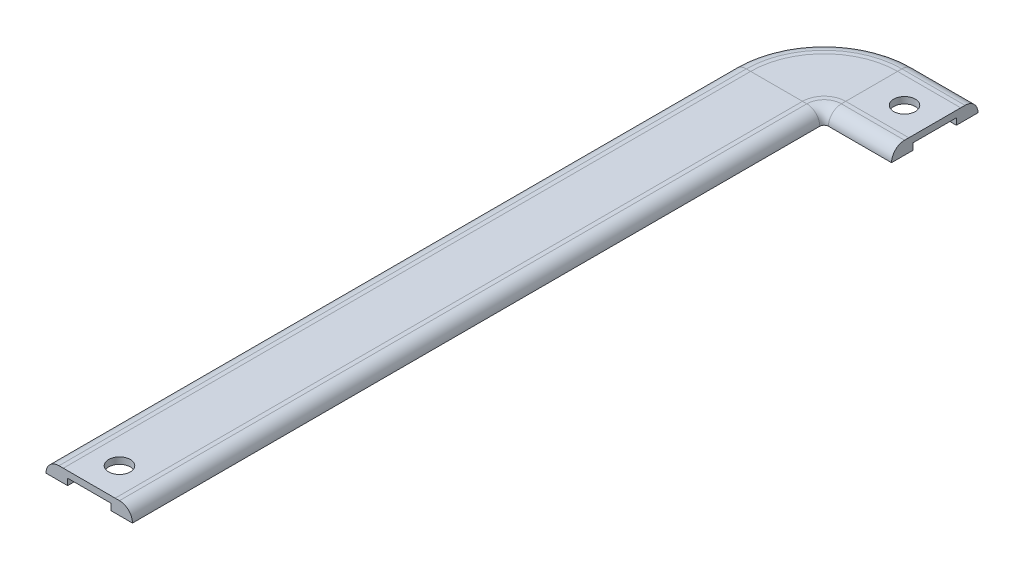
ISO-10303-21;
HEADER;
FILE_DESCRIPTION(('STEP AP214'),'2;1');
FILE_NAME('part.step','',(''),(''),'','','');
FILE_SCHEMA(('AUTOMOTIVE_DESIGN { 1 0 10303 214 1 1 1 1 }'));
ENDSEC;
DATA;
#1=APPLICATION_CONTEXT('core data for automotive mechanical design processes');
#2=APPLICATION_PROTOCOL_DEFINITION('international standard','automotive_design',2000,#1);
#3=PRODUCT_CONTEXT('',#1,'mechanical');
#4=PRODUCT('Part','Part','',(#3));
#5=PRODUCT_RELATED_PRODUCT_CATEGORY('part','',(#4));
#6=PRODUCT_DEFINITION_FORMATION('','',#4);
#7=PRODUCT_DEFINITION_CONTEXT('part definition',#1,'design');
#8=PRODUCT_DEFINITION('design','',#6,#7);
#9=PRODUCT_DEFINITION_SHAPE('','',#8);
#10=(LENGTH_UNIT() NAMED_UNIT(*) SI_UNIT(.MILLI.,.METRE.));
#11=(NAMED_UNIT(*) PLANE_ANGLE_UNIT() SI_UNIT($,.RADIAN.));
#12=(NAMED_UNIT(*) SI_UNIT($,.STERADIAN.) SOLID_ANGLE_UNIT());
#13=UNCERTAINTY_MEASURE_WITH_UNIT(LENGTH_MEASURE(1.E-05),#10,'distance_accuracy_value','');
#14=(GEOMETRIC_REPRESENTATION_CONTEXT(3) GLOBAL_UNCERTAINTY_ASSIGNED_CONTEXT((#13)) GLOBAL_UNIT_ASSIGNED_CONTEXT((#10,
#11,#12)) REPRESENTATION_CONTEXT('',''));
#15=CARTESIAN_POINT('',(0.,0.,0.));
#16=DIRECTION('',(0.,0.,1.));
#17=DIRECTION('',(1.,0.,0.));
#18=AXIS2_PLACEMENT_3D('',#15,#16,#17);
#19=CARTESIAN_POINT('',(50.,2.13734877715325,49.7811368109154));
#20=DIRECTION('',(0.,-1.,0.));
#21=DIRECTION('',(0.,0.,-1.));
#22=AXIS2_PLACEMENT_3D('',#19,#20,#21);
#23=PLANE('',#22);
#24=DIRECTION('',(0.,0.,1.));
#25=VECTOR('',#24,1.);
#26=CARTESIAN_POINT('',(171.936219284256,2.13734877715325,49.7811368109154));
#27=LINE('',#26,#25);
#28=CARTESIAN_POINT('',(171.936219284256,2.13734877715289,102.781136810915));
#29=VERTEX_POINT('',#28);
#30=CARTESIAN_POINT('',(171.936219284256,2.13734877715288,103.781136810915));
#31=VERTEX_POINT('',#30);
#32=EDGE_CURVE('E70',#29,#31,#27,.T.);
#33=ORIENTED_EDGE('',*,*,#32,.F.);
#34=DIRECTION('',(1.,0.,0.));
#35=VECTOR('',#34,1.);
#36=CARTESIAN_POINT('',(50.,2.13734877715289,102.781136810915));
#37=LINE('',#36,#35);
#38=CARTESIAN_POINT('',(157.336219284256,2.13734877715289,102.781136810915));
#39=VERTEX_POINT('',#38);
#40=EDGE_CURVE('E63',#29,#39,#37,.F.);
#41=ORIENTED_EDGE('',*,*,#40,.T.);
#42=DIRECTION('',(0.,0.,-1.));
#43=VECTOR('',#42,1.);
#44=CARTESIAN_POINT('',(157.336219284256,2.13734877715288,103.781136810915));
#45=LINE('',#44,#43);
#46=CARTESIAN_POINT('',(157.336219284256,2.13734877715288,103.781136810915));
#47=VERTEX_POINT('',#46);
#48=EDGE_CURVE('E243',#47,#39,#45,.T.);
#49=ORIENTED_EDGE('',*,*,#48,.F.);
#50=DIRECTION('',(1.,0.,0.));
#51=VECTOR('',#50,1.);
#52=CARTESIAN_POINT('',(157.336219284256,2.13734877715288,103.781136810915));
#53=LINE('',#52,#51);
#54=EDGE_CURVE('E222',#47,#31,#53,.T.);
#55=ORIENTED_EDGE('',*,*,#54,.T.);
#56=EDGE_LOOP('',(#33,#41,#49,#55));
#57=FACE_BOUND('',#56,.T.);
#58=ADVANCED_FACE('F55',(#57),#23,.F.);
#59=CARTESIAN_POINT('',(0.,-0.862651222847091,99.7811368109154));
#60=DIRECTION('',(0.,1.,0.));
#61=DIRECTION('',(0.,0.,1.));
#62=AXIS2_PLACEMENT_3D('',#59,#60,#61);
#63=PLANE('',#62);
#64=DIRECTION('',(0.,0.,-1.));
#65=VECTOR('',#64,1.);
#66=CARTESIAN_POINT('',(171.936219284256,-0.862651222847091,99.7811368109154));
#67=LINE('',#66,#65);
#68=CARTESIAN_POINT('',(171.936219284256,-0.862651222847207,119.781136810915));
#69=VERTEX_POINT('',#68);
#70=CARTESIAN_POINT('',(171.936219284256,-0.862651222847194,114.781136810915));
#71=VERTEX_POINT('',#70);
#72=EDGE_CURVE('E383',#69,#71,#67,.T.);
#73=ORIENTED_EDGE('',*,*,#72,.F.);
#74=DIRECTION('',(-1.,0.,0.));
#75=VECTOR('',#74,1.);
#76=CARTESIAN_POINT('',(180.,-0.862651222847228,119.781136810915));
#77=LINE('',#76,#75);
#78=CARTESIAN_POINT('',(157.336219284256,-0.862651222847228,119.781136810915));
#79=VERTEX_POINT('',#78);
#80=EDGE_CURVE('E212',#69,#79,#77,.T.);
#81=ORIENTED_EDGE('',*,*,#80,.T.);
#82=DIRECTION('',(0.,0.,1.));
#83=VECTOR('',#82,1.);
#84=CARTESIAN_POINT('',(157.336219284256,-0.862651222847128,114.781136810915));
#85=LINE('',#84,#83);
#86=CARTESIAN_POINT('',(157.336219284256,-0.862651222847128,114.781136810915));
#87=VERTEX_POINT('',#86);
#88=EDGE_CURVE('E307',#87,#79,#85,.T.);
#89=ORIENTED_EDGE('',*,*,#88,.F.);
#90=DIRECTION('',(-1.,0.,0.));
#91=VECTOR('',#90,1.);
#92=CARTESIAN_POINT('',(181.936219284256,-0.862651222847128,114.781136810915));
#93=LINE('',#92,#91);
#94=EDGE_CURVE('E221',#71,#87,#93,.T.);
#95=ORIENTED_EDGE('',*,*,#94,.F.);
#96=EDGE_LOOP('',(#73,#81,#89,#95));
#97=FACE_BOUND('',#96,.T.);
#98=ADVANCED_FACE('F57',(#97),#63,.F.);
#99=DIRECTION('',(0.,0.,1.));
#100=VECTOR('',#99,1.);
#101=CARTESIAN_POINT('',(171.936219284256,2.13734877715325,49.7811368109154));
#102=LINE('',#101,#100);
#103=CARTESIAN_POINT('',(171.936219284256,2.1373487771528,115.781136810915));
#104=VERTEX_POINT('',#103);
#105=CARTESIAN_POINT('',(171.936219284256,2.13734877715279,116.781136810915));
#106=VERTEX_POINT('',#105);
#107=EDGE_CURVE('E388',#104,#106,#102,.T.);
#108=ORIENTED_EDGE('',*,*,#107,.F.);
#109=DIRECTION('',(1.,0.,0.));
#110=VECTOR('',#109,1.);
#111=CARTESIAN_POINT('',(157.336219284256,2.1373487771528,115.781136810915));
#112=LINE('',#111,#110);
#113=CARTESIAN_POINT('',(157.336219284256,2.1373487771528,115.781136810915));
#114=VERTEX_POINT('',#113);
#115=EDGE_CURVE('E229',#114,#104,#112,.T.);
#116=ORIENTED_EDGE('',*,*,#115,.F.);
#117=DIRECTION('',(0.,0.,-1.));
#118=VECTOR('',#117,1.);
#119=CARTESIAN_POINT('',(157.336219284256,2.13734877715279,116.781136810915));
#120=LINE('',#119,#118);
#121=CARTESIAN_POINT('',(157.336219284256,2.13734877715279,116.781136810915));
#122=VERTEX_POINT('',#121);
#123=EDGE_CURVE('E277',#122,#114,#120,.T.);
#124=ORIENTED_EDGE('',*,*,#123,.F.);
#125=DIRECTION('',(-1.,0.,0.));
#126=VECTOR('',#125,1.);
#127=CARTESIAN_POINT('',(50.,2.13734877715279,116.781136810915));
#128=LINE('',#127,#126);
#129=EDGE_CURVE('E211',#122,#106,#128,.F.);
#130=ORIENTED_EDGE('',*,*,#129,.T.);
#131=EDGE_LOOP('',(#108,#116,#124,#130));
#132=FACE_BOUND('',#131,.T.);
#133=ADVANCED_FACE('F468',(#132),#23,.F.);
#134=CARTESIAN_POINT('',(180.,-0.862651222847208,116.781136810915));
#135=DIRECTION('',(-1.,0.,0.));
#136=DIRECTION('',(0.,0.,-1.));
#137=AXIS2_PLACEMENT_3D('',#134,#135,#136);
#138=CYLINDRICAL_SURFACE('',#137,3.);
#139=ORIENTED_EDGE('',*,*,#80,.F.);
#140=CARTESIAN_POINT('',(171.936219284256,-0.862651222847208,116.781136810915));
#141=DIRECTION('',(1.,0.,0.));
#142=DIRECTION('',(0.,0.,-1.));
#143=AXIS2_PLACEMENT_3D('',#140,#141,#142);
#144=CIRCLE('',#143,3.);
#145=EDGE_CURVE('E204',#69,#106,#144,.F.);
#146=ORIENTED_EDGE('',*,*,#145,.T.);
#147=ORIENTED_EDGE('',*,*,#129,.F.);
#148=CARTESIAN_POINT('',(157.336219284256,-0.862651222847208,116.781136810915));
#149=DIRECTION('',(-1.,0.,0.));
#150=DIRECTION('',(0.,0.,1.));
#151=AXIS2_PLACEMENT_3D('',#148,#149,#150);
#152=CIRCLE('',#151,3.);
#153=EDGE_CURVE('E292',#79,#122,#152,.T.);
#154=ORIENTED_EDGE('',*,*,#153,.F.);
#155=EDGE_LOOP('',(#139,#146,#147,#154));
#156=FACE_BOUND('',#155,.T.);
#157=ADVANCED_FACE('F465',(#156),#138,.T.);
#158=CARTESIAN_POINT('',(50.0000000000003,-0.862651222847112,102.781136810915));
#159=DIRECTION('',(1.,0.,0.));
#160=DIRECTION('',(0.,0.,1.));
#161=AXIS2_PLACEMENT_3D('',#158,#159,#160);
#162=CYLINDRICAL_SURFACE('',#161,3.);
#163=ORIENTED_EDGE('',*,*,#40,.F.);
#164=CARTESIAN_POINT('',(171.936219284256,-0.862651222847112,102.781136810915));
#165=DIRECTION('',(1.,0.,0.));
#166=DIRECTION('',(0.,0.,-1.));
#167=AXIS2_PLACEMENT_3D('',#164,#165,#166);
#168=CIRCLE('',#167,3.);
#169=CARTESIAN_POINT('',(171.936219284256,-0.862651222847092,99.7811368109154));
#170=VERTEX_POINT('',#169);
#171=EDGE_CURVE('E192',#29,#170,#168,.F.);
#172=ORIENTED_EDGE('',*,*,#171,.T.);
#173=DIRECTION('',(1.,0.,0.));
#174=VECTOR('',#173,1.);
#175=CARTESIAN_POINT('',(50.0000000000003,-0.862651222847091,99.7811368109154));
#176=LINE('',#175,#174);
#177=CARTESIAN_POINT('',(157.336219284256,-0.862651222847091,99.7811368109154));
#178=VERTEX_POINT('',#177);
#179=EDGE_CURVE('E202',#178,#170,#176,.T.);
#180=ORIENTED_EDGE('',*,*,#179,.F.);
#181=CARTESIAN_POINT('',(157.336219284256,-0.862651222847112,102.781136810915));
#182=DIRECTION('',(-1.,0.,0.));
#183=DIRECTION('',(0.,0.,1.));
#184=AXIS2_PLACEMENT_3D('',#181,#182,#183);
#185=CIRCLE('',#184,2.99999999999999);
#186=EDGE_CURVE('E227',#39,#178,#185,.T.);
#187=ORIENTED_EDGE('',*,*,#186,.F.);
#188=EDGE_LOOP('',(#163,#172,#180,#187));
#189=FACE_BOUND('',#188,.T.);
#190=ADVANCED_FACE('F201',(#189),#162,.T.);
#191=DIRECTION('',(0.,0.,-1.));
#192=VECTOR('',#191,1.);
#193=CARTESIAN_POINT('',(171.936219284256,-0.862651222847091,99.7811368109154));
#194=LINE('',#193,#192);
#195=CARTESIAN_POINT('',(171.936219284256,-0.862651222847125,104.781136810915));
#196=VERTEX_POINT('',#195);
#197=EDGE_CURVE('E189',#196,#170,#194,.T.);
#198=ORIENTED_EDGE('',*,*,#197,.F.);
#199=DIRECTION('',(-1.,0.,0.));
#200=VECTOR('',#199,1.);
#201=CARTESIAN_POINT('',(181.936219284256,-0.862651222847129,104.781136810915));
#202=LINE('',#201,#200);
#203=CARTESIAN_POINT('',(157.336219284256,-0.862651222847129,104.781136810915));
#204=VERTEX_POINT('',#203);
#205=EDGE_CURVE('E218',#196,#204,#202,.T.);
#206=ORIENTED_EDGE('',*,*,#205,.T.);
#207=DIRECTION('',(0.,0.,1.));
#208=VECTOR('',#207,1.);
#209=CARTESIAN_POINT('',(157.336219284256,-0.862651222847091,99.7811368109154));
#210=LINE('',#209,#208);
#211=EDGE_CURVE('E209',#178,#204,#210,.T.);
#212=ORIENTED_EDGE('',*,*,#211,.F.);
#213=ORIENTED_EDGE('',*,*,#179,.T.);
#214=EDGE_LOOP('',(#198,#206,#212,#213));
#215=FACE_BOUND('',#214,.T.);
#216=ADVANCED_FACE('F207',(#215),#63,.F.);
#217=CARTESIAN_POINT('',(50.,0.63734877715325,49.7811368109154));
#218=DIRECTION('',(0.,-1.,0.));
#219=DIRECTION('',(0.,0.,-1.));
#220=AXIS2_PLACEMENT_3D('',#217,#218,#219);
#221=PLANE('',#220);
#222=CARTESIAN_POINT('',(164.936219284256,0.637348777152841,109.781136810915));
#223=DIRECTION('',(0.,-1.,0.));
#224=DIRECTION('',(0.,0.,-1.));
#225=AXIS2_PLACEMENT_3D('',#222,#223,#224);
#226=CIRCLE('',#225,2.5);
#227=CARTESIAN_POINT('',(164.936219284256,0.637348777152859,107.281136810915));
#228=VERTEX_POINT('',#227);
#229=EDGE_CURVE('E393',#228,#228,#226,.T.);
#230=ORIENTED_EDGE('',*,*,#229,.F.);
#231=EDGE_LOOP('',(#230));
#232=FACE_BOUND('',#231,.T.);
#233=DIRECTION('',(-1.,0.,0.));
#234=VECTOR('',#233,1.);
#235=CARTESIAN_POINT('',(181.936219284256,0.637348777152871,104.781136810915));
#236=LINE('',#235,#234);
#237=CARTESIAN_POINT('',(171.936219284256,0.637348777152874,104.781136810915));
#238=VERTEX_POINT('',#237);
#239=CARTESIAN_POINT('',(157.336219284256,0.637348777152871,104.781136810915));
#240=VERTEX_POINT('',#239);
#241=EDGE_CURVE('E216',#238,#240,#236,.T.);
#242=ORIENTED_EDGE('',*,*,#241,.F.);
#243=DIRECTION('',(0.,0.,1.));
#244=VECTOR('',#243,1.);
#245=CARTESIAN_POINT('',(171.936219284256,0.63734877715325,49.7811368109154));
#246=LINE('',#245,#244);
#247=CARTESIAN_POINT('',(171.936219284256,0.637348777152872,114.781136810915));
#248=VERTEX_POINT('',#247);
#249=EDGE_CURVE('E198',#238,#248,#246,.T.);
#250=ORIENTED_EDGE('',*,*,#249,.T.);
#251=DIRECTION('',(-1.,0.,0.));
#252=VECTOR('',#251,1.);
#253=CARTESIAN_POINT('',(181.936219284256,0.637348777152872,114.781136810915));
#254=LINE('',#253,#252);
#255=CARTESIAN_POINT('',(157.336219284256,0.637348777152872,114.781136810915));
#256=VERTEX_POINT('',#255);
#257=EDGE_CURVE('E224',#248,#256,#254,.T.);
#258=ORIENTED_EDGE('',*,*,#257,.T.);
#259=DIRECTION('',(0.,0.,1.));
#260=VECTOR('',#259,1.);
#261=CARTESIAN_POINT('',(157.336219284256,0.637348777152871,104.781136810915));
#262=LINE('',#261,#260);
#263=EDGE_CURVE('E337',#240,#256,#262,.T.);
#264=ORIENTED_EDGE('',*,*,#263,.F.);
#265=EDGE_LOOP('',(#242,#250,#258,#264));
#266=FACE_BOUND('',#265,.T.);
#267=ADVANCED_FACE('F490',(#232,#266),#221,.T.);
#268=CARTESIAN_POINT('',(181.936219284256,-0.862651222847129,104.781136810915));
#269=DIRECTION('',(0.,0.,-1.));
#270=DIRECTION('',(-1.,0.,0.));
#271=AXIS2_PLACEMENT_3D('',#268,#269,#270);
#272=PLANE('',#271);
#273=DIRECTION('',(0.,-1.,0.));
#274=VECTOR('',#273,1.);
#275=CARTESIAN_POINT('',(171.936219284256,-0.862651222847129,104.781136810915));
#276=LINE('',#275,#274);
#277=EDGE_CURVE('E194',#238,#196,#276,.T.);
#278=ORIENTED_EDGE('',*,*,#277,.F.);
#279=ORIENTED_EDGE('',*,*,#241,.T.);
#280=DIRECTION('',(0.,1.,0.));
#281=VECTOR('',#280,1.);
#282=CARTESIAN_POINT('',(157.336219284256,-0.862651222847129,104.781136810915));
#283=LINE('',#282,#281);
#284=EDGE_CURVE('E352',#204,#240,#283,.T.);
#285=ORIENTED_EDGE('',*,*,#284,.F.);
#286=ORIENTED_EDGE('',*,*,#205,.F.);
#287=EDGE_LOOP('',(#278,#279,#285,#286));
#288=FACE_BOUND('',#287,.T.);
#289=ADVANCED_FACE('F495',(#288),#272,.F.);
#290=CARTESIAN_POINT('',(181.936219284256,-0.862651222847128,114.781136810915));
#291=DIRECTION('',(0.,0.,1.));
#292=DIRECTION('',(1.,0.,0.));
#293=AXIS2_PLACEMENT_3D('',#290,#291,#292);
#294=PLANE('',#293);
#295=DIRECTION('',(0.,1.,0.));
#296=VECTOR('',#295,1.);
#297=CARTESIAN_POINT('',(171.936219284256,-0.862651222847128,114.781136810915));
#298=LINE('',#297,#296);
#299=EDGE_CURVE('E381',#71,#248,#298,.T.);
#300=ORIENTED_EDGE('',*,*,#299,.F.);
#301=ORIENTED_EDGE('',*,*,#94,.T.);
#302=DIRECTION('',(0.,-1.,0.));
#303=VECTOR('',#302,1.);
#304=CARTESIAN_POINT('',(157.336219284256,0.637348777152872,114.781136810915));
#305=LINE('',#304,#303);
#306=EDGE_CURVE('E322',#256,#87,#305,.T.);
#307=ORIENTED_EDGE('',*,*,#306,.F.);
#308=ORIENTED_EDGE('',*,*,#257,.F.);
#309=EDGE_LOOP('',(#300,#301,#307,#308));
#310=FACE_BOUND('',#309,.T.);
#311=ADVANCED_FACE('F501',(#310),#294,.F.);
#312=CARTESIAN_POINT('',(139.336219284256,-0.862651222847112,279.781136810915));
#313=DIRECTION('',(0.,0.,1.));
#314=DIRECTION('',(1.,0.,0.));
#315=AXIS2_PLACEMENT_3D('',#312,#313,#314);
#316=PLANE('',#315);
#317=CARTESIAN_POINT('',(139.336219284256,-0.862651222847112,279.781136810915));
#318=DIRECTION('',(0.,0.,1.));
#319=DIRECTION('',(1.,0.,0.));
#320=AXIS2_PLACEMENT_3D('',#317,#318,#319);
#321=CIRCLE('',#320,2.99999999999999);
#322=CARTESIAN_POINT('',(139.336219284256,2.13734877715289,279.781136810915));
#323=VERTEX_POINT('',#322);
#324=CARTESIAN_POINT('',(136.336219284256,-0.862651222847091,279.781136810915));
#325=VERTEX_POINT('',#324);
#326=EDGE_CURVE('E236',#323,#325,#321,.T.);
#327=ORIENTED_EDGE('',*,*,#326,.T.);
#328=DIRECTION('',(1.,0.,0.));
#329=VECTOR('',#328,1.);
#330=CARTESIAN_POINT('',(136.336219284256,-0.862651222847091,279.781136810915));
#331=LINE('',#330,#329);
#332=CARTESIAN_POINT('',(141.336219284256,-0.862651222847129,279.781136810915));
#333=VERTEX_POINT('',#332);
#334=EDGE_CURVE('E364',#325,#333,#331,.T.);
#335=ORIENTED_EDGE('',*,*,#334,.T.);
#336=DIRECTION('',(0.,1.,0.));
#337=VECTOR('',#336,1.);
#338=CARTESIAN_POINT('',(141.336219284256,-0.862651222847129,279.781136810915));
#339=LINE('',#338,#337);
#340=CARTESIAN_POINT('',(141.336219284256,0.637348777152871,279.781136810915));
#341=VERTEX_POINT('',#340);
#342=EDGE_CURVE('E349',#333,#341,#339,.T.);
#343=ORIENTED_EDGE('',*,*,#342,.T.);
#344=DIRECTION('',(1.,0.,0.));
#345=VECTOR('',#344,1.);
#346=CARTESIAN_POINT('',(141.336219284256,0.637348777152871,279.781136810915));
#347=LINE('',#346,#345);
#348=CARTESIAN_POINT('',(151.336219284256,0.637348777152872,279.781136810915));
#349=VERTEX_POINT('',#348);
#350=EDGE_CURVE('E334',#341,#349,#347,.T.);
#351=ORIENTED_EDGE('',*,*,#350,.T.);
#352=DIRECTION('',(0.,-1.,0.));
#353=VECTOR('',#352,1.);
#354=CARTESIAN_POINT('',(151.336219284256,0.637348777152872,279.781136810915));
#355=LINE('',#354,#353);
#356=CARTESIAN_POINT('',(151.336219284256,-0.862651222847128,279.781136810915));
#357=VERTEX_POINT('',#356);
#358=EDGE_CURVE('E319',#349,#357,#355,.T.);
#359=ORIENTED_EDGE('',*,*,#358,.T.);
#360=DIRECTION('',(1.,0.,0.));
#361=VECTOR('',#360,1.);
#362=CARTESIAN_POINT('',(151.336219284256,-0.862651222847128,279.781136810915));
#363=LINE('',#362,#361);
#364=CARTESIAN_POINT('',(156.336219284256,-0.862651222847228,279.781136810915));
#365=VERTEX_POINT('',#364);
#366=EDGE_CURVE('E304',#357,#365,#363,.T.);
#367=ORIENTED_EDGE('',*,*,#366,.T.);
#368=CARTESIAN_POINT('',(153.336219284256,-0.862651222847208,279.781136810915));
#369=DIRECTION('',(0.,0.,1.));
#370=DIRECTION('',(1.,0.,0.));
#371=AXIS2_PLACEMENT_3D('',#368,#369,#370);
#372=CIRCLE('',#371,3.);
#373=CARTESIAN_POINT('',(153.336219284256,2.13734877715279,279.781136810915));
#374=VERTEX_POINT('',#373);
#375=EDGE_CURVE('E289',#365,#374,#372,.T.);
#376=ORIENTED_EDGE('',*,*,#375,.T.);
#377=DIRECTION('',(-1.,0.,0.));
#378=VECTOR('',#377,1.);
#379=CARTESIAN_POINT('',(153.336219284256,2.13734877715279,279.781136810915));
#380=LINE('',#379,#378);
#381=CARTESIAN_POINT('',(152.336219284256,2.1373487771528,279.781136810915));
#382=VERTEX_POINT('',#381);
#383=EDGE_CURVE('E272',#374,#382,#380,.T.);
#384=ORIENTED_EDGE('',*,*,#383,.T.);
#385=DIRECTION('',(-1.,0.,0.));
#386=VECTOR('',#385,1.);
#387=CARTESIAN_POINT('',(152.336219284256,2.1373487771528,279.781136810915));
#388=LINE('',#387,#386);
#389=CARTESIAN_POINT('',(140.336219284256,2.13734877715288,279.781136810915));
#390=VERTEX_POINT('',#389);
#391=EDGE_CURVE('E255',#382,#390,#388,.T.);
#392=ORIENTED_EDGE('',*,*,#391,.T.);
#393=DIRECTION('',(-1.,0.,0.));
#394=VECTOR('',#393,1.);
#395=CARTESIAN_POINT('',(140.336219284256,2.13734877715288,279.781136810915));
#396=LINE('',#395,#394);
#397=EDGE_CURVE('E240',#390,#323,#396,.T.);
#398=ORIENTED_EDGE('',*,*,#397,.T.);
#399=EDGE_LOOP('',(#327,#335,#343,#351,#359,#367,#376,#384,#392,#398));
#400=FACE_BOUND('',#399,.T.);
#401=ADVANCED_FACE('F418',(#400),#316,.T.);
#402=CARTESIAN_POINT('',(136.336219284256,-0.862651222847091,279.781136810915));
#403=DIRECTION('',(0.,1.,0.));
#404=DIRECTION('',(-1.,0.,0.));
#405=AXIS2_PLACEMENT_3D('',#402,#403,#404);
#406=PLANE('',#405);
#407=DIRECTION('',(0.,0.,-1.));
#408=VECTOR('',#407,1.);
#409=CARTESIAN_POINT('',(141.336219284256,-0.862651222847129,279.781136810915));
#410=LINE('',#409,#408);
#411=CARTESIAN_POINT('',(141.336219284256,-0.862651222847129,120.781136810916));
#412=VERTEX_POINT('',#411);
#413=EDGE_CURVE('E361',#333,#412,#410,.T.);
#414=ORIENTED_EDGE('',*,*,#413,.F.);
#415=ORIENTED_EDGE('',*,*,#334,.F.);
#416=DIRECTION('',(0.,0.,-1.));
#417=VECTOR('',#416,1.);
#418=CARTESIAN_POINT('',(136.336219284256,-0.862651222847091,279.781136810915));
#419=LINE('',#418,#417);
#420=CARTESIAN_POINT('',(136.336219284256,-0.862651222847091,120.781136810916));
#421=VERTEX_POINT('',#420);
#422=EDGE_CURVE('E239',#325,#421,#419,.T.);
#423=ORIENTED_EDGE('',*,*,#422,.T.);
#424=DIRECTION('',(1.,0.,0.));
#425=VECTOR('',#424,1.);
#426=CARTESIAN_POINT('',(136.336219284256,-0.862651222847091,120.781136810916));
#427=LINE('',#426,#425);
#428=EDGE_CURVE('E371',#421,#412,#427,.T.);
#429=ORIENTED_EDGE('',*,*,#428,.T.);
#430=EDGE_LOOP('',(#414,#415,#423,#429));
#431=FACE_BOUND('',#430,.T.);
#432=ADVANCED_FACE('F441',(#431),#406,.F.);
#433=CARTESIAN_POINT('',(141.336219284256,-0.862651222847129,279.781136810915));
#434=DIRECTION('',(-1.,0.,0.));
#435=DIRECTION('',(0.,0.,1.));
#436=AXIS2_PLACEMENT_3D('',#433,#434,#435);
#437=PLANE('',#436);
#438=DIRECTION('',(0.,0.,-1.));
#439=VECTOR('',#438,1.);
#440=CARTESIAN_POINT('',(141.336219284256,0.637348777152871,279.781136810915));
#441=LINE('',#440,#439);
#442=CARTESIAN_POINT('',(141.336219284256,0.637348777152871,120.781136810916));
#443=VERTEX_POINT('',#442);
#444=EDGE_CURVE('E346',#341,#443,#441,.T.);
#445=ORIENTED_EDGE('',*,*,#444,.F.);
#446=ORIENTED_EDGE('',*,*,#342,.F.);
#447=ORIENTED_EDGE('',*,*,#413,.T.);
#448=DIRECTION('',(0.,1.,0.));
#449=VECTOR('',#448,1.);
#450=CARTESIAN_POINT('',(141.336219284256,-0.862651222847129,120.781136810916));
#451=LINE('',#450,#449);
#452=EDGE_CURVE('E358',#412,#443,#451,.T.);
#453=ORIENTED_EDGE('',*,*,#452,.T.);
#454=EDGE_LOOP('',(#445,#446,#447,#453));
#455=FACE_BOUND('',#454,.T.);
#456=ADVANCED_FACE('F443',(#455),#437,.F.);
#457=CARTESIAN_POINT('',(141.336219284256,0.637348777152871,279.781136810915));
#458=DIRECTION('',(0.,1.,0.));
#459=DIRECTION('',(-1.,0.,0.));
#460=AXIS2_PLACEMENT_3D('',#457,#458,#459);
#461=PLANE('',#460);
#462=CARTESIAN_POINT('',(146.336219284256,0.637348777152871,272.781136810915));
#463=DIRECTION('',(0.,1.,0.));
#464=DIRECTION('',(-1.,0.,0.));
#465=AXIS2_PLACEMENT_3D('',#462,#463,#464);
#466=CIRCLE('',#465,2.5);
#467=CARTESIAN_POINT('',(143.836219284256,0.637348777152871,272.781136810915));
#468=VERTEX_POINT('',#467);
#469=EDGE_CURVE('E390',#468,#468,#466,.T.);
#470=ORIENTED_EDGE('',*,*,#469,.T.);
#471=EDGE_LOOP('',(#470));
#472=FACE_BOUND('',#471,.T.);
#473=DIRECTION('',(0.,0.,-1.));
#474=VECTOR('',#473,1.);
#475=CARTESIAN_POINT('',(151.336219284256,0.637348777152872,279.781136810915));
#476=LINE('',#475,#474);
#477=CARTESIAN_POINT('',(151.336219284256,0.637348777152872,120.781136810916));
#478=VERTEX_POINT('',#477);
#479=EDGE_CURVE('E331',#349,#478,#476,.T.);
#480=ORIENTED_EDGE('',*,*,#479,.F.);
#481=ORIENTED_EDGE('',*,*,#350,.F.);
#482=ORIENTED_EDGE('',*,*,#444,.T.);
#483=DIRECTION('',(1.,0.,0.));
#484=VECTOR('',#483,1.);
#485=CARTESIAN_POINT('',(141.336219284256,0.637348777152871,120.781136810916));
#486=LINE('',#485,#484);
#487=EDGE_CURVE('E343',#443,#478,#486,.T.);
#488=ORIENTED_EDGE('',*,*,#487,.T.);
#489=EDGE_LOOP('',(#480,#481,#482,#488));
#490=FACE_BOUND('',#489,.T.);
#491=ADVANCED_FACE('F447',(#472,#490),#461,.F.);
#492=CARTESIAN_POINT('',(151.336219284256,0.637348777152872,279.781136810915));
#493=DIRECTION('',(1.,0.,0.));
#494=DIRECTION('',(0.,0.,-1.));
#495=AXIS2_PLACEMENT_3D('',#492,#493,#494);
#496=PLANE('',#495);
#497=DIRECTION('',(0.,0.,-1.));
#498=VECTOR('',#497,1.);
#499=CARTESIAN_POINT('',(151.336219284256,-0.862651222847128,279.781136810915));
#500=LINE('',#499,#498);
#501=CARTESIAN_POINT('',(151.336219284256,-0.862651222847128,120.781136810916));
#502=VERTEX_POINT('',#501);
#503=EDGE_CURVE('E316',#357,#502,#500,.T.);
#504=ORIENTED_EDGE('',*,*,#503,.F.);
#505=ORIENTED_EDGE('',*,*,#358,.F.);
#506=ORIENTED_EDGE('',*,*,#479,.T.);
#507=DIRECTION('',(0.,-1.,0.));
#508=VECTOR('',#507,1.);
#509=CARTESIAN_POINT('',(151.336219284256,0.637348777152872,120.781136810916));
#510=LINE('',#509,#508);
#511=EDGE_CURVE('E328',#478,#502,#510,.T.);
#512=ORIENTED_EDGE('',*,*,#511,.T.);
#513=EDGE_LOOP('',(#504,#505,#506,#512));
#514=FACE_BOUND('',#513,.T.);
#515=ADVANCED_FACE('F452',(#514),#496,.F.);
#516=CARTESIAN_POINT('',(151.336219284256,-0.862651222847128,279.781136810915));
#517=DIRECTION('',(0.,1.,0.));
#518=DIRECTION('',(-1.,0.,0.));
#519=AXIS2_PLACEMENT_3D('',#516,#517,#518);
#520=PLANE('',#519);
#521=DIRECTION('',(0.,0.,-1.));
#522=VECTOR('',#521,1.);
#523=CARTESIAN_POINT('',(156.336219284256,-0.862651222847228,279.781136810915));
#524=LINE('',#523,#522);
#525=CARTESIAN_POINT('',(156.336219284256,-0.862651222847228,120.781136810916));
#526=VERTEX_POINT('',#525);
#527=EDGE_CURVE('E301',#365,#526,#524,.T.);
#528=ORIENTED_EDGE('',*,*,#527,.F.);
#529=ORIENTED_EDGE('',*,*,#366,.F.);
#530=ORIENTED_EDGE('',*,*,#503,.T.);
#531=DIRECTION('',(1.,0.,0.));
#532=VECTOR('',#531,1.);
#533=CARTESIAN_POINT('',(151.336219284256,-0.862651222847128,120.781136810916));
#534=LINE('',#533,#532);
#535=EDGE_CURVE('E313',#502,#526,#534,.T.);
#536=ORIENTED_EDGE('',*,*,#535,.T.);
#537=EDGE_LOOP('',(#528,#529,#530,#536));
#538=FACE_BOUND('',#537,.T.);
#539=ADVANCED_FACE('F455',(#538),#520,.F.);
#540=CARTESIAN_POINT('',(153.336219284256,-0.862651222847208,279.781136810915));
#541=DIRECTION('',(0.,0.,-1.));
#542=DIRECTION('',(-1.,0.,0.));
#543=AXIS2_PLACEMENT_3D('',#540,#541,#542);
#544=CYLINDRICAL_SURFACE('',#543,3.);
#545=DIRECTION('',(0.,0.,-1.));
#546=VECTOR('',#545,1.);
#547=CARTESIAN_POINT('',(153.336219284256,2.13734877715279,279.781136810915));
#548=LINE('',#547,#546);
#549=CARTESIAN_POINT('',(153.336219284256,2.13734877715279,120.781136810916));
#550=VERTEX_POINT('',#549);
#551=EDGE_CURVE('E286',#374,#550,#548,.T.);
#552=ORIENTED_EDGE('',*,*,#551,.F.);
#553=ORIENTED_EDGE('',*,*,#375,.F.);
#554=ORIENTED_EDGE('',*,*,#527,.T.);
#555=CARTESIAN_POINT('',(153.336219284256,-0.862651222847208,120.781136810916));
#556=DIRECTION('',(0.,0.,1.));
#557=DIRECTION('',(1.,0.,0.));
#558=AXIS2_PLACEMENT_3D('',#555,#556,#557);
#559=CIRCLE('',#558,3.);
#560=EDGE_CURVE('E298',#526,#550,#559,.T.);
#561=ORIENTED_EDGE('',*,*,#560,.T.);
#562=EDGE_LOOP('',(#552,#553,#554,#561));
#563=FACE_BOUND('',#562,.T.);
#564=ADVANCED_FACE('F458',(#563),#544,.T.);
#565=CARTESIAN_POINT('',(153.336219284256,2.13734877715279,279.781136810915));
#566=DIRECTION('',(0.,-1.,0.));
#567=DIRECTION('',(1.,0.,0.));
#568=AXIS2_PLACEMENT_3D('',#565,#566,#567);
#569=PLANE('',#568);
#570=DIRECTION('',(0.,0.,-1.));
#571=VECTOR('',#570,1.);
#572=CARTESIAN_POINT('',(152.336219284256,2.1373487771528,279.781136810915));
#573=LINE('',#572,#571);
#574=CARTESIAN_POINT('',(152.336219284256,2.1373487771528,120.781136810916));
#575=VERTEX_POINT('',#574);
#576=EDGE_CURVE('E269',#382,#575,#573,.T.);
#577=ORIENTED_EDGE('',*,*,#576,.F.);
#578=ORIENTED_EDGE('',*,*,#383,.F.);
#579=ORIENTED_EDGE('',*,*,#551,.T.);
#580=DIRECTION('',(-1.,0.,0.));
#581=VECTOR('',#580,1.);
#582=CARTESIAN_POINT('',(153.336219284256,2.13734877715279,120.781136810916));
#583=LINE('',#582,#581);
#584=EDGE_CURVE('E283',#550,#575,#583,.T.);
#585=ORIENTED_EDGE('',*,*,#584,.T.);
#586=EDGE_LOOP('',(#577,#578,#579,#585));
#587=FACE_BOUND('',#586,.T.);
#588=ADVANCED_FACE('F410',(#587),#569,.F.);
#589=CARTESIAN_POINT('',(152.336219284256,2.1373487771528,279.781136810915));
#590=DIRECTION('',(0.,-1.,0.));
#591=DIRECTION('',(1.,0.,0.));
#592=AXIS2_PLACEMENT_3D('',#589,#590,#591);
#593=PLANE('',#592);
#594=CARTESIAN_POINT('',(146.336219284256,2.13734877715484,272.781136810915));
#595=DIRECTION('',(0.,1.,0.));
#596=DIRECTION('',(-1.,0.,0.));
#597=AXIS2_PLACEMENT_3D('',#594,#595,#596);
#598=CIRCLE('',#597,2.5);
#599=CARTESIAN_POINT('',(143.836219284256,2.13734877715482,272.781136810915));
#600=VERTEX_POINT('',#599);
#601=EDGE_CURVE('E396',#600,#600,#598,.T.);
#602=ORIENTED_EDGE('',*,*,#601,.F.);
#603=EDGE_LOOP('',(#602));
#604=FACE_BOUND('',#603,.T.);
#605=DIRECTION('',(0.,0.,-1.));
#606=VECTOR('',#605,1.);
#607=CARTESIAN_POINT('',(140.336219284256,2.13734877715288,279.781136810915));
#608=LINE('',#607,#606);
#609=CARTESIAN_POINT('',(140.336219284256,2.13734877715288,120.781136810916));
#610=VERTEX_POINT('',#609);
#611=EDGE_CURVE('E252',#390,#610,#608,.T.);
#612=ORIENTED_EDGE('',*,*,#611,.F.);
#613=ORIENTED_EDGE('',*,*,#391,.F.);
#614=ORIENTED_EDGE('',*,*,#576,.T.);
#615=DIRECTION('',(-1.,0.,0.));
#616=VECTOR('',#615,1.);
#617=CARTESIAN_POINT('',(152.336219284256,2.1373487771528,120.781136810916));
#618=LINE('',#617,#616);
#619=EDGE_CURVE('E266',#575,#610,#618,.T.);
#620=ORIENTED_EDGE('',*,*,#619,.T.);
#621=EDGE_LOOP('',(#612,#613,#614,#620));
#622=FACE_BOUND('',#621,.T.);
#623=ADVANCED_FACE('F406',(#604,#622),#593,.F.);
#624=CARTESIAN_POINT('',(140.336219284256,2.13734877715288,279.781136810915));
#625=DIRECTION('',(0.,-1.,0.));
#626=DIRECTION('',(1.,0.,0.));
#627=AXIS2_PLACEMENT_3D('',#624,#625,#626);
#628=PLANE('',#627);
#629=DIRECTION('',(0.,0.,-1.));
#630=VECTOR('',#629,1.);
#631=CARTESIAN_POINT('',(139.336219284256,2.13734877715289,279.781136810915));
#632=LINE('',#631,#630);
#633=CARTESIAN_POINT('',(139.336219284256,2.13734877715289,120.781136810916));
#634=VERTEX_POINT('',#633);
#635=EDGE_CURVE('E235',#323,#634,#632,.T.);
#636=ORIENTED_EDGE('',*,*,#635,.F.);
#637=ORIENTED_EDGE('',*,*,#397,.F.);
#638=ORIENTED_EDGE('',*,*,#611,.T.);
#639=DIRECTION('',(-1.,0.,0.));
#640=VECTOR('',#639,1.);
#641=CARTESIAN_POINT('',(140.336219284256,2.13734877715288,120.781136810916));
#642=LINE('',#641,#640);
#643=EDGE_CURVE('E249',#610,#634,#642,.T.);
#644=ORIENTED_EDGE('',*,*,#643,.T.);
#645=EDGE_LOOP('',(#636,#637,#638,#644));
#646=FACE_BOUND('',#645,.T.);
#647=ADVANCED_FACE('F409',(#646),#628,.F.);
#648=CARTESIAN_POINT('',(139.336219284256,-0.862651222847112,279.781136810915));
#649=DIRECTION('',(0.,0.,-1.));
#650=DIRECTION('',(-1.,0.,0.));
#651=AXIS2_PLACEMENT_3D('',#648,#649,#650);
#652=CYLINDRICAL_SURFACE('',#651,2.99999999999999);
#653=CARTESIAN_POINT('',(139.336219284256,-0.862651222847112,120.781136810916));
#654=DIRECTION('',(0.,0.,1.));
#655=DIRECTION('',(1.,0.,0.));
#656=AXIS2_PLACEMENT_3D('',#653,#654,#655);
#657=CIRCLE('',#656,2.99999999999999);
#658=EDGE_CURVE('E231',#634,#421,#657,.T.);
#659=ORIENTED_EDGE('',*,*,#658,.T.);
#660=ORIENTED_EDGE('',*,*,#422,.F.);
#661=ORIENTED_EDGE('',*,*,#326,.F.);
#662=ORIENTED_EDGE('',*,*,#635,.T.);
#663=EDGE_LOOP('',(#659,#660,#661,#662));
#664=FACE_BOUND('',#663,.T.);
#665=ADVANCED_FACE('F437',(#664),#652,.T.);
#666=CARTESIAN_POINT('',(136.336219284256,-0.86265122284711,120.781136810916));
#667=DIRECTION('',(0.,1.,0.));
#668=DIRECTION('',(0.,0.,1.));
#669=AXIS2_PLACEMENT_3D('',#666,#667,#668);
#670=PLANE('',#669);
#671=CARTESIAN_POINT('',(157.336219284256,-0.862651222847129,120.781136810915));
#672=DIRECTION('',(0.,-1.,0.));
#673=DIRECTION('',(-1.,0.,0.));
#674=AXIS2_PLACEMENT_3D('',#671,#672,#673);
#675=CIRCLE('',#674,16.);
#676=EDGE_CURVE('E355',#412,#204,#675,.T.);
#677=ORIENTED_EDGE('',*,*,#676,.F.);
#678=ORIENTED_EDGE('',*,*,#428,.F.);
#679=CARTESIAN_POINT('',(157.336219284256,-0.862651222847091,120.781136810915));
#680=DIRECTION('',(0.,-1.,0.));
#681=DIRECTION('',(-1.,0.,0.));
#682=AXIS2_PLACEMENT_3D('',#679,#680,#681);
#683=CIRCLE('',#682,21.);
#684=EDGE_CURVE('E234',#421,#178,#683,.T.);
#685=ORIENTED_EDGE('',*,*,#684,.T.);
#686=ORIENTED_EDGE('',*,*,#211,.T.);
#687=EDGE_LOOP('',(#677,#678,#685,#686));
#688=FACE_BOUND('',#687,.T.);
#689=ADVANCED_FACE('F515',(#688),#670,.F.);
#690=CARTESIAN_POINT('',(157.336219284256,-0.862651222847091,120.781136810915));
#691=DIRECTION('',(0.,-1.,0.));
#692=DIRECTION('',(0.,0.,-1.));
#693=AXIS2_PLACEMENT_3D('',#690,#691,#692);
#694=CYLINDRICAL_SURFACE('',#693,16.);
#695=CARTESIAN_POINT('',(157.336219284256,0.637348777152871,120.781136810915));
#696=DIRECTION('',(0.,-1.,0.));
#697=DIRECTION('',(-1.,0.,0.));
#698=AXIS2_PLACEMENT_3D('',#695,#696,#697);
#699=CIRCLE('',#698,16.);
#700=EDGE_CURVE('E340',#443,#240,#699,.T.);
#701=ORIENTED_EDGE('',*,*,#700,.F.);
#702=ORIENTED_EDGE('',*,*,#452,.F.);
#703=ORIENTED_EDGE('',*,*,#676,.T.);
#704=ORIENTED_EDGE('',*,*,#284,.T.);
#705=EDGE_LOOP('',(#701,#702,#703,#704));
#706=FACE_BOUND('',#705,.T.);
#707=ADVANCED_FACE('F548',(#706),#694,.F.);
#708=CARTESIAN_POINT('',(141.336219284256,0.637348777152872,120.781136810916));
#709=DIRECTION('',(0.,1.,0.));
#710=DIRECTION('',(0.,0.,1.));
#711=AXIS2_PLACEMENT_3D('',#708,#709,#710);
#712=PLANE('',#711);
#713=CARTESIAN_POINT('',(157.336219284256,0.637348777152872,120.781136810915));
#714=DIRECTION('',(0.,-1.,0.));
#715=DIRECTION('',(-1.,0.,0.));
#716=AXIS2_PLACEMENT_3D('',#713,#714,#715);
#717=CIRCLE('',#716,6.00000000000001);
#718=EDGE_CURVE('E325',#478,#256,#717,.T.);
#719=ORIENTED_EDGE('',*,*,#718,.F.);
#720=ORIENTED_EDGE('',*,*,#487,.F.);
#721=ORIENTED_EDGE('',*,*,#700,.T.);
#722=ORIENTED_EDGE('',*,*,#263,.T.);
#723=EDGE_LOOP('',(#719,#720,#721,#722));
#724=FACE_BOUND('',#723,.T.);
#725=ADVANCED_FACE('F542',(#724),#712,.F.);
#726=CARTESIAN_POINT('',(157.336219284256,-0.862651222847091,120.781136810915));
#727=DIRECTION('',(0.,-1.,0.));
#728=DIRECTION('',(0.,0.,-1.));
#729=AXIS2_PLACEMENT_3D('',#726,#727,#728);
#730=CYLINDRICAL_SURFACE('',#729,6.00000000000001);
#731=CARTESIAN_POINT('',(157.336219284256,-0.862651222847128,120.781136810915));
#732=DIRECTION('',(0.,-1.,0.));
#733=DIRECTION('',(-1.,0.,0.));
#734=AXIS2_PLACEMENT_3D('',#731,#732,#733);
#735=CIRCLE('',#734,6.00000000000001);
#736=EDGE_CURVE('E310',#502,#87,#735,.T.);
#737=ORIENTED_EDGE('',*,*,#736,.F.);
#738=ORIENTED_EDGE('',*,*,#511,.F.);
#739=ORIENTED_EDGE('',*,*,#718,.T.);
#740=ORIENTED_EDGE('',*,*,#306,.T.);
#741=EDGE_LOOP('',(#737,#738,#739,#740));
#742=FACE_BOUND('',#741,.T.);
#743=ADVANCED_FACE('F536',(#742),#730,.T.);
#744=CARTESIAN_POINT('',(151.336219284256,-0.862651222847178,120.781136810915));
#745=DIRECTION('',(0.,1.,0.));
#746=DIRECTION('',(0.,0.,1.));
#747=AXIS2_PLACEMENT_3D('',#744,#745,#746);
#748=PLANE('',#747);
#749=CARTESIAN_POINT('',(157.336219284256,-0.862651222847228,120.781136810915));
#750=DIRECTION('',(0.,-1.,0.));
#751=DIRECTION('',(-1.,0.,0.));
#752=AXIS2_PLACEMENT_3D('',#749,#750,#751);
#753=CIRCLE('',#752,1.00000000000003);
#754=EDGE_CURVE('E295',#526,#79,#753,.T.);
#755=ORIENTED_EDGE('',*,*,#754,.F.);
#756=ORIENTED_EDGE('',*,*,#535,.F.);
#757=ORIENTED_EDGE('',*,*,#736,.T.);
#758=ORIENTED_EDGE('',*,*,#88,.T.);
#759=EDGE_LOOP('',(#755,#756,#757,#758));
#760=FACE_BOUND('',#759,.T.);
#761=ADVANCED_FACE('F531',(#760),#748,.F.);
#762=CARTESIAN_POINT('',(157.336219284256,-0.862651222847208,120.781136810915));
#763=DIRECTION('',(0.,-1.,0.));
#764=DIRECTION('',(0.,0.,-1.));
#765=AXIS2_PLACEMENT_3D('',#762,#763,#764);
#766=TOROIDAL_SURFACE('',#765,4.00000000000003,3.);
#767=CARTESIAN_POINT('',(157.336219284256,2.13734877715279,120.781136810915));
#768=DIRECTION('',(0.,-1.,0.));
#769=DIRECTION('',(-1.,0.,0.));
#770=AXIS2_PLACEMENT_3D('',#767,#768,#769);
#771=CIRCLE('',#770,4.);
#772=EDGE_CURVE('E280',#550,#122,#771,.T.);
#773=ORIENTED_EDGE('',*,*,#772,.F.);
#774=ORIENTED_EDGE('',*,*,#560,.F.);
#775=ORIENTED_EDGE('',*,*,#754,.T.);
#776=ORIENTED_EDGE('',*,*,#153,.T.);
#777=EDGE_LOOP('',(#773,#774,#775,#776));
#778=FACE_BOUND('',#777,.T.);
#779=ADVANCED_FACE('F461',(#778),#766,.T.);
#780=CARTESIAN_POINT('',(153.336219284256,2.1373487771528,120.781136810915));
#781=DIRECTION('',(0.,-1.,0.));
#782=DIRECTION('',(0.,0.,-1.));
#783=AXIS2_PLACEMENT_3D('',#780,#781,#782);
#784=PLANE('',#783);
#785=CARTESIAN_POINT('',(157.336219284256,2.1373487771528,120.781136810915));
#786=DIRECTION('',(0.,-1.,0.));
#787=DIRECTION('',(-1.,0.,0.));
#788=AXIS2_PLACEMENT_3D('',#785,#786,#787);
#789=CIRCLE('',#788,5.00000000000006);
#790=EDGE_CURVE('E263',#575,#114,#789,.T.);
#791=ORIENTED_EDGE('',*,*,#790,.F.);
#792=ORIENTED_EDGE('',*,*,#584,.F.);
#793=ORIENTED_EDGE('',*,*,#772,.T.);
#794=ORIENTED_EDGE('',*,*,#123,.T.);
#795=EDGE_LOOP('',(#791,#792,#793,#794));
#796=FACE_BOUND('',#795,.T.);
#797=ADVANCED_FACE('F424',(#796),#784,.F.);
#798=CARTESIAN_POINT('',(152.336219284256,2.13734877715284,120.781136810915));
#799=DIRECTION('',(0.,-1.,0.));
#800=DIRECTION('',(0.,0.,-1.));
#801=AXIS2_PLACEMENT_3D('',#798,#799,#800);
#802=PLANE('',#801);
#803=CARTESIAN_POINT('',(157.336219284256,2.13734877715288,120.781136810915));
#804=DIRECTION('',(0.,-1.,0.));
#805=DIRECTION('',(-1.,0.,0.));
#806=AXIS2_PLACEMENT_3D('',#803,#804,#805);
#807=CIRCLE('',#806,17.);
#808=EDGE_CURVE('E246',#610,#47,#807,.T.);
#809=ORIENTED_EDGE('',*,*,#808,.F.);
#810=ORIENTED_EDGE('',*,*,#619,.F.);
#811=ORIENTED_EDGE('',*,*,#790,.T.);
#812=DIRECTION('',(0.,0.,-1.));
#813=VECTOR('',#812,1.);
#814=CARTESIAN_POINT('',(157.336219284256,2.1373487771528,115.781136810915));
#815=LINE('',#814,#813);
#816=EDGE_CURVE('E260',#114,#47,#815,.T.);
#817=ORIENTED_EDGE('',*,*,#816,.T.);
#818=EDGE_LOOP('',(#809,#810,#811,#817));
#819=FACE_BOUND('',#818,.T.);
#820=ADVANCED_FACE('F427',(#819),#802,.F.);
#821=CARTESIAN_POINT('',(140.336219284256,2.13734877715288,120.781136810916));
#822=DIRECTION('',(0.,-1.,0.));
#823=DIRECTION('',(0.,0.,-1.));
#824=AXIS2_PLACEMENT_3D('',#821,#822,#823);
#825=PLANE('',#824);
#826=CARTESIAN_POINT('',(157.336219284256,2.13734877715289,120.781136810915));
#827=DIRECTION('',(0.,-1.,0.));
#828=DIRECTION('',(-1.,0.,0.));
#829=AXIS2_PLACEMENT_3D('',#826,#827,#828);
#830=CIRCLE('',#829,18.);
#831=EDGE_CURVE('E230',#634,#39,#830,.T.);
#832=ORIENTED_EDGE('',*,*,#831,.F.);
#833=ORIENTED_EDGE('',*,*,#643,.F.);
#834=ORIENTED_EDGE('',*,*,#808,.T.);
#835=ORIENTED_EDGE('',*,*,#48,.T.);
#836=EDGE_LOOP('',(#832,#833,#834,#835));
#837=FACE_BOUND('',#836,.T.);
#838=ADVANCED_FACE('F430',(#837),#825,.F.);
#839=CARTESIAN_POINT('',(157.336219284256,-0.862651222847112,120.781136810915));
#840=DIRECTION('',(0.,-1.,0.));
#841=DIRECTION('',(0.,0.,-1.));
#842=AXIS2_PLACEMENT_3D('',#839,#840,#841);
#843=TOROIDAL_SURFACE('',#842,18.,2.99999999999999);
#844=ORIENTED_EDGE('',*,*,#186,.T.);
#845=ORIENTED_EDGE('',*,*,#684,.F.);
#846=ORIENTED_EDGE('',*,*,#658,.F.);
#847=ORIENTED_EDGE('',*,*,#831,.T.);
#848=EDGE_LOOP('',(#844,#845,#846,#847));
#849=FACE_BOUND('',#848,.T.);
#850=ADVANCED_FACE('F433',(#849),#843,.T.);
#851=CARTESIAN_POINT('',(157.336219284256,2.1373487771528,115.781136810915));
#852=DIRECTION('',(0.,-1.,0.));
#853=DIRECTION('',(0.,0.,-1.));
#854=AXIS2_PLACEMENT_3D('',#851,#852,#853);
#855=PLANE('',#854);
#856=CARTESIAN_POINT('',(164.936219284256,2.13734877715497,109.781136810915));
#857=DIRECTION('',(0.,1.,0.));
#858=DIRECTION('',(-1.,0.,0.));
#859=AXIS2_PLACEMENT_3D('',#856,#857,#858);
#860=CIRCLE('',#859,2.5);
#861=CARTESIAN_POINT('',(162.436219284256,2.13734877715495,109.781136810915));
#862=VERTEX_POINT('',#861);
#863=EDGE_CURVE('E397',#862,#862,#860,.T.);
#864=ORIENTED_EDGE('',*,*,#863,.F.);
#865=EDGE_LOOP('',(#864));
#866=FACE_BOUND('',#865,.T.);
#867=ORIENTED_EDGE('',*,*,#54,.F.);
#868=ORIENTED_EDGE('',*,*,#816,.F.);
#869=ORIENTED_EDGE('',*,*,#115,.T.);
#870=DIRECTION('',(0.,0.,-1.));
#871=VECTOR('',#870,1.);
#872=CARTESIAN_POINT('',(171.936219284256,2.13734877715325,49.7811368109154));
#873=LINE('',#872,#871);
#874=EDGE_CURVE('E12',#104,#31,#873,.T.);
#875=ORIENTED_EDGE('',*,*,#874,.T.);
#876=EDGE_LOOP('',(#867,#868,#869,#875));
#877=FACE_BOUND('',#876,.T.);
#878=ADVANCED_FACE('F470',(#866,#877),#855,.F.);
#879=CARTESIAN_POINT('',(171.936219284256,10.,99.7811368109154));
#880=DIRECTION('',(1.,0.,0.));
#881=DIRECTION('',(0.,0.,-1.));
#882=AXIS2_PLACEMENT_3D('',#879,#880,#881);
#883=PLANE('',#882);
#884=ORIENTED_EDGE('',*,*,#277,.T.);
#885=ORIENTED_EDGE('',*,*,#197,.T.);
#886=ORIENTED_EDGE('',*,*,#171,.F.);
#887=ORIENTED_EDGE('',*,*,#32,.T.);
#888=ORIENTED_EDGE('',*,*,#874,.F.);
#889=ORIENTED_EDGE('',*,*,#107,.T.);
#890=ORIENTED_EDGE('',*,*,#145,.F.);
#891=ORIENTED_EDGE('',*,*,#72,.T.);
#892=ORIENTED_EDGE('',*,*,#299,.T.);
#893=ORIENTED_EDGE('',*,*,#249,.F.);
#894=EDGE_LOOP('',(#884,#885,#886,#887,#888,#889,#890,#891,#892,#893));
#895=FACE_BOUND('',#894,.T.);
#896=ADVANCED_FACE('F191',(#895),#883,.T.);
#897=CARTESIAN_POINT('',(164.936219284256,-7.93371903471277,109.781136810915));
#898=DIRECTION('',(0.,1.,0.));
#899=DIRECTION('',(-1.,0.,0.));
#900=AXIS2_PLACEMENT_3D('',#897,#898,#899);
#901=CYLINDRICAL_SURFACE('',#900,2.5);
#902=ORIENTED_EDGE('',*,*,#229,.T.);
#903=EDGE_LOOP('',(#902));
#904=FACE_BOUND('',#903,.T.);
#905=ORIENTED_EDGE('',*,*,#863,.T.);
#906=EDGE_LOOP('',(#905));
#907=FACE_BOUND('',#906,.T.);
#908=ADVANCED_FACE('F563',(#904,#907),#901,.F.);
#909=CARTESIAN_POINT('',(146.336219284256,-7.9337190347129,272.781136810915));
#910=DIRECTION('',(0.,1.,0.));
#911=DIRECTION('',(-1.,0.,0.));
#912=AXIS2_PLACEMENT_3D('',#909,#910,#911);
#913=CYLINDRICAL_SURFACE('',#912,2.5);
#914=ORIENTED_EDGE('',*,*,#601,.T.);
#915=EDGE_LOOP('',(#914));
#916=FACE_BOUND('',#915,.T.);
#917=ORIENTED_EDGE('',*,*,#469,.F.);
#918=EDGE_LOOP('',(#917));
#919=FACE_BOUND('',#918,.T.);
#920=ADVANCED_FACE('F403',(#916,#919),#913,.F.);
#921=CLOSED_SHELL('',(#58,#98,#133,#157,#190,#216,#267,#289,#311,#401,#432,#456,#491,#515,#539,
#564,#588,#623,#647,#665,#689,#707,#725,#743,#761,#779,#797,#820,#838,#850,#878,#896,#908,#920));
#922=MANIFOLD_SOLID_BREP('B2',#921);
#923=ADVANCED_BREP_SHAPE_REPRESENTATION('',(#18,#922),#14);
#924=SHAPE_DEFINITION_REPRESENTATION(#9,#923);
ENDSEC;
END-ISO-10303-21;
